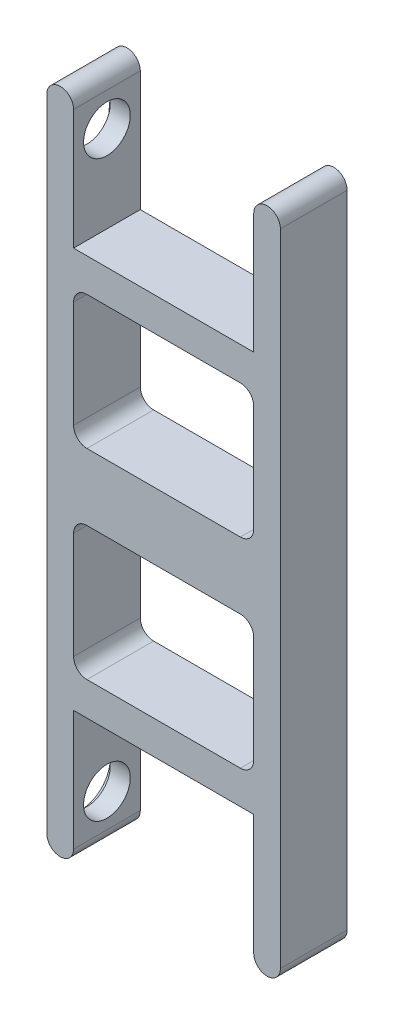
ISO-10303-21;
HEADER;
FILE_DESCRIPTION(('STEP AP214'),'2;1');
FILE_NAME('part.step','',(''),(''),'','','');
FILE_SCHEMA(('AUTOMOTIVE_DESIGN { 1 0 10303 214 1 1 1 1 }'));
ENDSEC;
DATA;
#1=APPLICATION_CONTEXT('core data for automotive mechanical design processes');
#2=APPLICATION_PROTOCOL_DEFINITION('international standard','automotive_design',2000,#1);
#3=PRODUCT_CONTEXT('',#1,'mechanical');
#4=PRODUCT('Part','Part','',(#3));
#5=PRODUCT_RELATED_PRODUCT_CATEGORY('part','',(#4));
#6=PRODUCT_DEFINITION_FORMATION('','',#4);
#7=PRODUCT_DEFINITION_CONTEXT('part definition',#1,'design');
#8=PRODUCT_DEFINITION('design','',#6,#7);
#9=PRODUCT_DEFINITION_SHAPE('','',#8);
#10=(LENGTH_UNIT() NAMED_UNIT(*) SI_UNIT(.MILLI.,.METRE.));
#11=(NAMED_UNIT(*) PLANE_ANGLE_UNIT() SI_UNIT($,.RADIAN.));
#12=(NAMED_UNIT(*) SI_UNIT($,.STERADIAN.) SOLID_ANGLE_UNIT());
#13=UNCERTAINTY_MEASURE_WITH_UNIT(LENGTH_MEASURE(1.E-05),#10,'distance_accuracy_value','');
#14=(GEOMETRIC_REPRESENTATION_CONTEXT(3) GLOBAL_UNCERTAINTY_ASSIGNED_CONTEXT((#13)) GLOBAL_UNIT_ASSIGNED_CONTEXT((#10,
#11,#12)) REPRESENTATION_CONTEXT('',''));
#15=CARTESIAN_POINT('',(0.,0.,0.));
#16=DIRECTION('',(0.,0.,1.));
#17=DIRECTION('',(1.,0.,0.));
#18=AXIS2_PLACEMENT_3D('',#15,#16,#17);
#19=CARTESIAN_POINT('',(17.501,-43.,5.));
#20=DIRECTION('',(-1.,0.,0.));
#21=DIRECTION('',(0.,0.,1.));
#22=AXIS2_PLACEMENT_3D('',#19,#20,#21);
#23=CYLINDRICAL_SURFACE('',#22,3.5);
#24=CARTESIAN_POINT('',(-13.5000000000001,-43.,5.));
#25=DIRECTION('',(-1.,0.,0.));
#26=DIRECTION('',(0.,-1.,0.));
#27=AXIS2_PLACEMENT_3D('',#24,#25,#26);
#28=CIRCLE('',#27,3.5);
#29=CARTESIAN_POINT('',(-13.5000000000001,-46.5,5.));
#30=VERTEX_POINT('',#29);
#31=EDGE_CURVE('E369',#30,#30,#28,.F.);
#32=ORIENTED_EDGE('',*,*,#31,.T.);
#33=EDGE_LOOP('',(#32));
#34=FACE_BOUND('',#33,.T.);
#35=CARTESIAN_POINT('',(-16.5,-43.,5.));
#36=DIRECTION('',(-1.,0.,0.));
#37=DIRECTION('',(0.,0.,1.));
#38=AXIS2_PLACEMENT_3D('',#35,#36,#37);
#39=CIRCLE('',#38,3.5);
#40=CARTESIAN_POINT('',(-16.5,-43.,8.5));
#41=VERTEX_POINT('',#40);
#42=EDGE_CURVE('E322',#41,#41,#39,.F.);
#43=ORIENTED_EDGE('',*,*,#42,.F.);
#44=EDGE_LOOP('',(#43));
#45=FACE_BOUND('',#44,.T.);
#46=ADVANCED_FACE('F40',(#34,#45),#23,.F.);
#47=CARTESIAN_POINT('',(15.5,-48.,0.));
#48=DIRECTION('',(0.,0.,1.));
#49=DIRECTION('',(1.,0.,0.));
#50=AXIS2_PLACEMENT_3D('',#47,#48,#49);
#51=CYLINDRICAL_SURFACE('',#50,2.00000000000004);
#52=DIRECTION('',(0.,0.,1.));
#53=VECTOR('',#52,1.);
#54=CARTESIAN_POINT('',(13.4999999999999,-48.,0.));
#55=LINE('',#54,#53);
#56=CARTESIAN_POINT('',(13.4999999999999,-48.,0.));
#57=VERTEX_POINT('',#56);
#58=CARTESIAN_POINT('',(13.4999999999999,-48.,10.));
#59=VERTEX_POINT('',#58);
#60=EDGE_CURVE('E556',#57,#59,#55,.T.);
#61=ORIENTED_EDGE('',*,*,#60,.F.);
#62=CARTESIAN_POINT('',(15.5,-48.,0.));
#63=DIRECTION('',(0.,0.,-1.));
#64=DIRECTION('',(-1.,0.,0.));
#65=AXIS2_PLACEMENT_3D('',#62,#63,#64);
#66=CIRCLE('',#65,2.00000000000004);
#67=CARTESIAN_POINT('',(17.5,-48.,0.));
#68=VERTEX_POINT('',#67);
#69=EDGE_CURVE('E564',#68,#57,#66,.T.);
#70=ORIENTED_EDGE('',*,*,#69,.F.);
#71=DIRECTION('',(0.,0.,1.));
#72=VECTOR('',#71,1.);
#73=CARTESIAN_POINT('',(17.5,-48.,10.));
#74=LINE('',#73,#72);
#75=CARTESIAN_POINT('',(17.5,-48.,10.));
#76=VERTEX_POINT('',#75);
#77=EDGE_CURVE('E560',#76,#68,#74,.F.);
#78=ORIENTED_EDGE('',*,*,#77,.F.);
#79=CARTESIAN_POINT('',(15.5,-48.,10.));
#80=DIRECTION('',(0.,0.,-1.));
#81=DIRECTION('',(-1.,0.,0.));
#82=AXIS2_PLACEMENT_3D('',#79,#80,#81);
#83=CIRCLE('',#82,2.00000000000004);
#84=EDGE_CURVE('E567',#59,#76,#83,.F.);
#85=ORIENTED_EDGE('',*,*,#84,.F.);
#86=EDGE_LOOP('',(#61,#70,#78,#85));
#87=FACE_BOUND('',#86,.T.);
#88=ADVANCED_FACE('F695',(#87),#51,.T.);
#89=CARTESIAN_POINT('',(-15.5,-48.,10.));
#90=DIRECTION('',(0.,0.,1.));
#91=DIRECTION('',(1.,0.,0.));
#92=AXIS2_PLACEMENT_3D('',#89,#90,#91);
#93=CYLINDRICAL_SURFACE('',#92,1.99999999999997);
#94=DIRECTION('',(0.,0.,1.));
#95=VECTOR('',#94,1.);
#96=CARTESIAN_POINT('',(-13.5000000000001,-48.,0.));
#97=LINE('',#96,#95);
#98=CARTESIAN_POINT('',(-13.5000000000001,-48.,10.));
#99=VERTEX_POINT('',#98);
#100=CARTESIAN_POINT('',(-13.5000000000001,-48.,0.));
#101=VERTEX_POINT('',#100);
#102=EDGE_CURVE('E542',#99,#101,#97,.F.);
#103=ORIENTED_EDGE('',*,*,#102,.F.);
#104=CARTESIAN_POINT('',(-15.5,-48.,10.));
#105=DIRECTION('',(0.,0.,-1.));
#106=DIRECTION('',(-1.,0.,0.));
#107=AXIS2_PLACEMENT_3D('',#104,#105,#106);
#108=CIRCLE('',#107,1.99999999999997);
#109=CARTESIAN_POINT('',(-17.5,-47.9999999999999,10.));
#110=VERTEX_POINT('',#109);
#111=EDGE_CURVE('E550',#110,#99,#108,.F.);
#112=ORIENTED_EDGE('',*,*,#111,.F.);
#113=DIRECTION('',(0.,0.,1.));
#114=VECTOR('',#113,1.);
#115=CARTESIAN_POINT('',(-17.5,-48.,10.));
#116=LINE('',#115,#114);
#117=CARTESIAN_POINT('',(-17.5,-47.9999999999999,0.));
#118=VERTEX_POINT('',#117);
#119=EDGE_CURVE('E546',#118,#110,#116,.T.);
#120=ORIENTED_EDGE('',*,*,#119,.F.);
#121=CARTESIAN_POINT('',(-15.5,-48.,0.));
#122=DIRECTION('',(0.,0.,-1.));
#123=DIRECTION('',(-1.,0.,0.));
#124=AXIS2_PLACEMENT_3D('',#121,#122,#123);
#125=CIRCLE('',#124,1.99999999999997);
#126=EDGE_CURVE('E553',#101,#118,#125,.T.);
#127=ORIENTED_EDGE('',*,*,#126,.F.);
#128=EDGE_LOOP('',(#103,#112,#120,#127));
#129=FACE_BOUND('',#128,.T.);
#130=ADVANCED_FACE('F703',(#129),#93,.T.);
#131=CARTESIAN_POINT('',(15.5,48.,0.));
#132=DIRECTION('',(0.,0.,-1.));
#133=DIRECTION('',(-1.,0.,0.));
#134=AXIS2_PLACEMENT_3D('',#131,#132,#133);
#135=CYLINDRICAL_SURFACE('',#134,2.00000000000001);
#136=DIRECTION('',(0.,0.,-1.));
#137=VECTOR('',#136,1.);
#138=CARTESIAN_POINT('',(17.5,48.,10.));
#139=LINE('',#138,#137);
#140=CARTESIAN_POINT('',(17.5,48.,0.));
#141=VERTEX_POINT('',#140);
#142=CARTESIAN_POINT('',(17.5,48.,10.));
#143=VERTEX_POINT('',#142);
#144=EDGE_CURVE('E527',#141,#143,#139,.F.);
#145=ORIENTED_EDGE('',*,*,#144,.F.);
#146=CARTESIAN_POINT('',(15.5,48.,0.));
#147=DIRECTION('',(0.,0.,-1.));
#148=DIRECTION('',(-1.,0.,0.));
#149=AXIS2_PLACEMENT_3D('',#146,#147,#148);
#150=CIRCLE('',#149,2.00000000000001);
#151=CARTESIAN_POINT('',(13.5,48.,0.));
#152=VERTEX_POINT('',#151);
#153=EDGE_CURVE('E535',#152,#141,#150,.T.);
#154=ORIENTED_EDGE('',*,*,#153,.F.);
#155=DIRECTION('',(0.,0.,-1.));
#156=VECTOR('',#155,1.);
#157=CARTESIAN_POINT('',(13.5,48.,0.));
#158=LINE('',#157,#156);
#159=CARTESIAN_POINT('',(13.5,48.,10.));
#160=VERTEX_POINT('',#159);
#161=EDGE_CURVE('E531',#160,#152,#158,.T.);
#162=ORIENTED_EDGE('',*,*,#161,.F.);
#163=CARTESIAN_POINT('',(15.5,48.,10.));
#164=DIRECTION('',(0.,0.,-1.));
#165=DIRECTION('',(-1.,0.,0.));
#166=AXIS2_PLACEMENT_3D('',#163,#164,#165);
#167=CIRCLE('',#166,2.00000000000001);
#168=EDGE_CURVE('E539',#143,#160,#167,.F.);
#169=ORIENTED_EDGE('',*,*,#168,.F.);
#170=EDGE_LOOP('',(#145,#154,#162,#169));
#171=FACE_BOUND('',#170,.T.);
#172=ADVANCED_FACE('F790',(#171),#135,.T.);
#173=CARTESIAN_POINT('',(-15.5,48.,10.));
#174=DIRECTION('',(0.,0.,-1.));
#175=DIRECTION('',(-1.,0.,0.));
#176=AXIS2_PLACEMENT_3D('',#173,#174,#175);
#177=CYLINDRICAL_SURFACE('',#176,2.);
#178=DIRECTION('',(0.,0.,-1.));
#179=VECTOR('',#178,1.);
#180=CARTESIAN_POINT('',(-17.5,48.,10.));
#181=LINE('',#180,#179);
#182=CARTESIAN_POINT('',(-17.5,48.,10.));
#183=VERTEX_POINT('',#182);
#184=CARTESIAN_POINT('',(-17.5,48.,0.));
#185=VERTEX_POINT('',#184);
#186=EDGE_CURVE('E508',#183,#185,#181,.T.);
#187=ORIENTED_EDGE('',*,*,#186,.F.);
#188=CARTESIAN_POINT('',(-15.5,48.,10.));
#189=DIRECTION('',(0.,0.,-1.));
#190=DIRECTION('',(-1.,0.,0.));
#191=AXIS2_PLACEMENT_3D('',#188,#189,#190);
#192=CIRCLE('',#191,2.);
#193=CARTESIAN_POINT('',(-13.5,48.,10.));
#194=VERTEX_POINT('',#193);
#195=EDGE_CURVE('E521',#194,#183,#192,.F.);
#196=ORIENTED_EDGE('',*,*,#195,.F.);
#197=DIRECTION('',(0.,0.,-1.));
#198=VECTOR('',#197,1.);
#199=CARTESIAN_POINT('',(-13.5,48.,0.));
#200=LINE('',#199,#198);
#201=CARTESIAN_POINT('',(-13.5,48.,0.));
#202=VERTEX_POINT('',#201);
#203=EDGE_CURVE('E517',#202,#194,#200,.F.);
#204=ORIENTED_EDGE('',*,*,#203,.F.);
#205=CARTESIAN_POINT('',(-15.5,48.,0.));
#206=DIRECTION('',(0.,0.,-1.));
#207=DIRECTION('',(-1.,0.,0.));
#208=AXIS2_PLACEMENT_3D('',#205,#206,#207);
#209=CIRCLE('',#208,2.);
#210=EDGE_CURVE('E524',#185,#202,#209,.T.);
#211=ORIENTED_EDGE('',*,*,#210,.F.);
#212=EDGE_LOOP('',(#187,#196,#204,#211));
#213=FACE_BOUND('',#212,.T.);
#214=ADVANCED_FACE('F782',(#213),#177,.T.);
#215=CARTESIAN_POINT('',(17.5,-50.,10.));
#216=DIRECTION('',(-1.,0.,0.));
#217=DIRECTION('',(0.,0.,1.));
#218=AXIS2_PLACEMENT_3D('',#215,#216,#217);
#219=PLANE('',#218);
#220=DIRECTION('',(0.,1.,0.));
#221=VECTOR('',#220,1.);
#222=CARTESIAN_POINT('',(17.5,-50.,10.));
#223=LINE('',#222,#221);
#224=EDGE_CURVE('E500',#76,#143,#223,.T.);
#225=ORIENTED_EDGE('',*,*,#224,.F.);
#226=ORIENTED_EDGE('',*,*,#77,.T.);
#227=DIRECTION('',(0.,1.,0.));
#228=VECTOR('',#227,1.);
#229=CARTESIAN_POINT('',(17.5,-50.,0.));
#230=LINE('',#229,#228);
#231=EDGE_CURVE('E469',#68,#141,#230,.T.);
#232=ORIENTED_EDGE('',*,*,#231,.T.);
#233=ORIENTED_EDGE('',*,*,#144,.T.);
#234=EDGE_LOOP('',(#225,#226,#232,#233));
#235=FACE_BOUND('',#234,.T.);
#236=ADVANCED_FACE('F778',(#235),#219,.F.);
#237=CARTESIAN_POINT('',(-17.5,-50.,10.));
#238=DIRECTION('',(1.,0.,0.));
#239=DIRECTION('',(0.,0.,-1.));
#240=AXIS2_PLACEMENT_3D('',#237,#238,#239);
#241=PLANE('',#240);
#242=DIRECTION('',(0.,0.995037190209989,-0.0995037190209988));
#243=VECTOR('',#242,1.);
#244=CARTESIAN_POINT('',(-17.5,-43.,9.5));
#245=LINE('',#244,#243);
#246=CARTESIAN_POINT('',(-17.5,-43.,9.5));
#247=VERTEX_POINT('',#246);
#248=CARTESIAN_POINT('',(-17.5,-28.,8.));
#249=VERTEX_POINT('',#248);
#250=EDGE_CURVE('E312',#247,#249,#245,.T.);
#251=ORIENTED_EDGE('',*,*,#250,.F.);
#252=CARTESIAN_POINT('',(-17.5,-43.,5.));
#253=DIRECTION('',(-1.,0.,0.));
#254=DIRECTION('',(0.,0.,1.));
#255=AXIS2_PLACEMENT_3D('',#252,#253,#254);
#256=CIRCLE('',#255,4.5);
#257=CARTESIAN_POINT('',(-17.5,-43.,0.500000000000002));
#258=VERTEX_POINT('',#257);
#259=EDGE_CURVE('E58',#258,#247,#256,.T.);
#260=ORIENTED_EDGE('',*,*,#259,.F.);
#261=DIRECTION('',(0.,-0.995037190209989,-0.0995037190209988));
#262=VECTOR('',#261,1.);
#263=CARTESIAN_POINT('',(-17.5,-43.,0.500000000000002));
#264=LINE('',#263,#262);
#265=CARTESIAN_POINT('',(-17.5,-28.,2.));
#266=VERTEX_POINT('',#265);
#267=EDGE_CURVE('E299',#266,#258,#264,.T.);
#268=ORIENTED_EDGE('',*,*,#267,.F.);
#269=CARTESIAN_POINT('',(-17.5,-28.,5.));
#270=DIRECTION('',(-1.,0.,0.));
#271=DIRECTION('',(0.,0.,1.));
#272=AXIS2_PLACEMENT_3D('',#269,#270,#271);
#273=CIRCLE('',#272,3.);
#274=EDGE_CURVE('E303',#249,#266,#273,.T.);
#275=ORIENTED_EDGE('',*,*,#274,.F.);
#276=EDGE_LOOP('',(#251,#260,#268,#275));
#277=FACE_BOUND('',#276,.T.);
#278=DIRECTION('',(0.,0.995037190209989,0.099503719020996));
#279=VECTOR('',#278,1.);
#280=CARTESIAN_POINT('',(-17.5,43.,9.49999999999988));
#281=LINE('',#280,#279);
#282=CARTESIAN_POINT('',(-17.5,28.,7.99999999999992));
#283=VERTEX_POINT('',#282);
#284=CARTESIAN_POINT('',(-17.5,43.,9.49999999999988));
#285=VERTEX_POINT('',#284);
#286=EDGE_CURVE('E348',#283,#285,#281,.T.);
#287=ORIENTED_EDGE('',*,*,#286,.F.);
#288=CARTESIAN_POINT('',(-17.5,28.,4.99999999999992));
#289=DIRECTION('',(-1.,0.,0.));
#290=DIRECTION('',(0.,0.,-1.));
#291=AXIS2_PLACEMENT_3D('',#288,#289,#290);
#292=CIRCLE('',#291,3.);
#293=CARTESIAN_POINT('',(-17.5,28.,1.99999999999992));
#294=VERTEX_POINT('',#293);
#295=EDGE_CURVE('E66',#294,#283,#292,.T.);
#296=ORIENTED_EDGE('',*,*,#295,.F.);
#297=DIRECTION('',(0.,-0.995037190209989,0.0995037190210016));
#298=VECTOR('',#297,1.);
#299=CARTESIAN_POINT('',(-17.5,43.,0.499999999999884));
#300=LINE('',#299,#298);
#301=CARTESIAN_POINT('',(-17.5,43.,0.499999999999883));
#302=VERTEX_POINT('',#301);
#303=EDGE_CURVE('E333',#302,#294,#300,.T.);
#304=ORIENTED_EDGE('',*,*,#303,.F.);
#305=CARTESIAN_POINT('',(-17.5,43.,4.99999999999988));
#306=DIRECTION('',(-1.,0.,0.));
#307=DIRECTION('',(0.,0.,-1.));
#308=AXIS2_PLACEMENT_3D('',#305,#306,#307);
#309=CIRCLE('',#308,4.5);
#310=EDGE_CURVE('E352',#285,#302,#309,.T.);
#311=ORIENTED_EDGE('',*,*,#310,.F.);
#312=EDGE_LOOP('',(#287,#296,#304,#311));
#313=FACE_BOUND('',#312,.T.);
#314=DIRECTION('',(0.,-1.,0.));
#315=VECTOR('',#314,1.);
#316=CARTESIAN_POINT('',(-17.5,-50.,0.));
#317=LINE('',#316,#315);
#318=EDGE_CURVE('E504',#185,#118,#317,.T.);
#319=ORIENTED_EDGE('',*,*,#318,.T.);
#320=ORIENTED_EDGE('',*,*,#119,.T.);
#321=DIRECTION('',(0.,-1.,0.));
#322=VECTOR('',#321,1.);
#323=CARTESIAN_POINT('',(-17.5,-50.,10.));
#324=LINE('',#323,#322);
#325=EDGE_CURVE('E503',#183,#110,#324,.T.);
#326=ORIENTED_EDGE('',*,*,#325,.F.);
#327=ORIENTED_EDGE('',*,*,#186,.T.);
#328=EDGE_LOOP('',(#319,#320,#326,#327));
#329=FACE_BOUND('',#328,.T.);
#330=ADVANCED_FACE('F771',(#277,#313,#329),#241,.F.);
#331=CARTESIAN_POINT('',(0.,0.,10.));
#332=DIRECTION('',(0.,0.,-1.));
#333=DIRECTION('',(-1.,0.,0.));
#334=AXIS2_PLACEMENT_3D('',#331,#332,#333);
#335=PLANE('',#334);
#336=DIRECTION('',(0.,-1.,0.));
#337=VECTOR('',#336,1.);
#338=CARTESIAN_POINT('',(13.5,-25.,10.));
#339=LINE('',#338,#337);
#340=CARTESIAN_POINT('',(13.5,-7.,10.));
#341=VERTEX_POINT('',#340);
#342=CARTESIAN_POINT('',(13.5,-23.,10.));
#343=VERTEX_POINT('',#342);
#344=EDGE_CURVE('E387',#341,#343,#339,.T.);
#345=ORIENTED_EDGE('',*,*,#344,.T.);
#346=CARTESIAN_POINT('',(11.5,-23.,10.));
#347=DIRECTION('',(0.,0.,-1.));
#348=DIRECTION('',(-1.,0.,0.));
#349=AXIS2_PLACEMENT_3D('',#346,#347,#348);
#350=CIRCLE('',#349,2.);
#351=CARTESIAN_POINT('',(11.5,-25.,10.));
#352=VERTEX_POINT('',#351);
#353=EDGE_CURVE('E665',#343,#352,#350,.T.);
#354=ORIENTED_EDGE('',*,*,#353,.T.);
#355=DIRECTION('',(-1.,0.,0.));
#356=VECTOR('',#355,1.);
#357=CARTESIAN_POINT('',(-13.5,-25.,10.));
#358=LINE('',#357,#356);
#359=CARTESIAN_POINT('',(-11.5,-25.,10.));
#360=VERTEX_POINT('',#359);
#361=EDGE_CURVE('E391',#352,#360,#358,.T.);
#362=ORIENTED_EDGE('',*,*,#361,.T.);
#363=CARTESIAN_POINT('',(-11.5,-23.,10.));
#364=DIRECTION('',(0.,0.,-1.));
#365=DIRECTION('',(-1.,0.,0.));
#366=AXIS2_PLACEMENT_3D('',#363,#364,#365);
#367=CIRCLE('',#366,2.);
#368=CARTESIAN_POINT('',(-13.5,-23.,10.));
#369=VERTEX_POINT('',#368);
#370=EDGE_CURVE('E11',#360,#369,#367,.T.);
#371=ORIENTED_EDGE('',*,*,#370,.T.);
#372=DIRECTION('',(0.,1.,0.));
#373=VECTOR('',#372,1.);
#374=CARTESIAN_POINT('',(-13.5,-25.,10.));
#375=LINE('',#374,#373);
#376=CARTESIAN_POINT('',(-13.5,-7.,10.));
#377=VERTEX_POINT('',#376);
#378=EDGE_CURVE('E378',#369,#377,#375,.T.);
#379=ORIENTED_EDGE('',*,*,#378,.T.);
#380=CARTESIAN_POINT('',(-11.5,-7.,10.));
#381=DIRECTION('',(0.,0.,-1.));
#382=DIRECTION('',(-1.,0.,0.));
#383=AXIS2_PLACEMENT_3D('',#380,#381,#382);
#384=CIRCLE('',#383,2.);
#385=CARTESIAN_POINT('',(-11.5,-5.,10.));
#386=VERTEX_POINT('',#385);
#387=EDGE_CURVE('E653',#377,#386,#384,.T.);
#388=ORIENTED_EDGE('',*,*,#387,.T.);
#389=DIRECTION('',(1.,0.,0.));
#390=VECTOR('',#389,1.);
#391=CARTESIAN_POINT('',(-13.5,-5.,10.));
#392=LINE('',#391,#390);
#393=CARTESIAN_POINT('',(11.5,-5.,10.));
#394=VERTEX_POINT('',#393);
#395=EDGE_CURVE('E382',#386,#394,#392,.T.);
#396=ORIENTED_EDGE('',*,*,#395,.T.);
#397=CARTESIAN_POINT('',(11.5,-7.,10.));
#398=DIRECTION('',(0.,0.,-1.));
#399=DIRECTION('',(-1.,0.,0.));
#400=AXIS2_PLACEMENT_3D('',#397,#398,#399);
#401=CIRCLE('',#400,2.);
#402=EDGE_CURVE('E659',#394,#341,#401,.T.);
#403=ORIENTED_EDGE('',*,*,#402,.T.);
#404=EDGE_LOOP('',(#345,#354,#362,#371,#379,#388,#396,#403));
#405=FACE_BOUND('',#404,.T.);
#406=DIRECTION('',(0.,-1.,0.));
#407=VECTOR('',#406,1.);
#408=CARTESIAN_POINT('',(13.5,25.,10.));
#409=LINE('',#408,#407);
#410=CARTESIAN_POINT('',(13.5,23.,10.));
#411=VERTEX_POINT('',#410);
#412=CARTESIAN_POINT('',(13.5,7.00000000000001,10.));
#413=VERTEX_POINT('',#412);
#414=EDGE_CURVE('E421',#411,#413,#409,.T.);
#415=ORIENTED_EDGE('',*,*,#414,.T.);
#416=CARTESIAN_POINT('',(11.5,7.00000000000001,10.));
#417=DIRECTION('',(0.,0.,-1.));
#418=DIRECTION('',(-1.,0.,0.));
#419=AXIS2_PLACEMENT_3D('',#416,#417,#418);
#420=CIRCLE('',#419,2.);
#421=CARTESIAN_POINT('',(11.5,5.00000000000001,10.));
#422=VERTEX_POINT('',#421);
#423=EDGE_CURVE('E641',#413,#422,#420,.T.);
#424=ORIENTED_EDGE('',*,*,#423,.T.);
#425=DIRECTION('',(-1.,0.,0.));
#426=VECTOR('',#425,1.);
#427=CARTESIAN_POINT('',(-13.5,5.00000000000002,10.));
#428=LINE('',#427,#426);
#429=CARTESIAN_POINT('',(-11.5,5.00000000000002,10.));
#430=VERTEX_POINT('',#429);
#431=EDGE_CURVE('E401',#422,#430,#428,.T.);
#432=ORIENTED_EDGE('',*,*,#431,.T.);
#433=CARTESIAN_POINT('',(-11.5,7.00000000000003,10.));
#434=DIRECTION('',(0.,0.,-1.));
#435=DIRECTION('',(-1.,0.,0.));
#436=AXIS2_PLACEMENT_3D('',#433,#434,#435);
#437=CIRCLE('',#436,2.);
#438=CARTESIAN_POINT('',(-13.5,7.00000000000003,10.));
#439=VERTEX_POINT('',#438);
#440=EDGE_CURVE('E647',#430,#439,#437,.T.);
#441=ORIENTED_EDGE('',*,*,#440,.T.);
#442=DIRECTION('',(0.,1.,0.));
#443=VECTOR('',#442,1.);
#444=CARTESIAN_POINT('',(-13.5,25.,10.));
#445=LINE('',#444,#443);
#446=CARTESIAN_POINT('',(-13.5,23.,10.));
#447=VERTEX_POINT('',#446);
#448=EDGE_CURVE('E412',#439,#447,#445,.T.);
#449=ORIENTED_EDGE('',*,*,#448,.T.);
#450=CARTESIAN_POINT('',(-11.5,23.,10.));
#451=DIRECTION('',(0.,0.,-1.));
#452=DIRECTION('',(-1.,0.,0.));
#453=AXIS2_PLACEMENT_3D('',#450,#451,#452);
#454=CIRCLE('',#453,2.);
#455=CARTESIAN_POINT('',(-11.5,25.,10.));
#456=VERTEX_POINT('',#455);
#457=EDGE_CURVE('E635',#447,#456,#454,.T.);
#458=ORIENTED_EDGE('',*,*,#457,.T.);
#459=DIRECTION('',(1.,0.,0.));
#460=VECTOR('',#459,1.);
#461=CARTESIAN_POINT('',(-13.5,25.,10.));
#462=LINE('',#461,#460);
#463=CARTESIAN_POINT('',(11.5,25.,10.));
#464=VERTEX_POINT('',#463);
#465=EDGE_CURVE('E416',#456,#464,#462,.T.);
#466=ORIENTED_EDGE('',*,*,#465,.T.);
#467=CARTESIAN_POINT('',(11.5,23.,10.));
#468=DIRECTION('',(0.,0.,-1.));
#469=DIRECTION('',(-1.,0.,0.));
#470=AXIS2_PLACEMENT_3D('',#467,#468,#469);
#471=CIRCLE('',#470,2.);
#472=EDGE_CURVE('E629',#464,#411,#471,.T.);
#473=ORIENTED_EDGE('',*,*,#472,.T.);
#474=EDGE_LOOP('',(#415,#424,#432,#441,#449,#458,#466,#473));
#475=FACE_BOUND('',#474,.T.);
#476=DIRECTION('',(0.,1.,0.));
#477=VECTOR('',#476,1.);
#478=CARTESIAN_POINT('',(13.4999999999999,-50.,10.));
#479=LINE('',#478,#477);
#480=CARTESIAN_POINT('',(13.5,-30.,10.));
#481=VERTEX_POINT('',#480);
#482=EDGE_CURVE('E489',#59,#481,#479,.T.);
#483=ORIENTED_EDGE('',*,*,#482,.F.);
#484=ORIENTED_EDGE('',*,*,#84,.T.);
#485=ORIENTED_EDGE('',*,*,#224,.T.);
#486=ORIENTED_EDGE('',*,*,#168,.T.);
#487=DIRECTION('',(0.,1.,0.));
#488=VECTOR('',#487,1.);
#489=CARTESIAN_POINT('',(13.5,50.,10.));
#490=LINE('',#489,#488);
#491=CARTESIAN_POINT('',(13.5,30.,10.));
#492=VERTEX_POINT('',#491);
#493=EDGE_CURVE('E446',#492,#160,#490,.T.);
#494=ORIENTED_EDGE('',*,*,#493,.F.);
#495=DIRECTION('',(1.,0.,0.));
#496=VECTOR('',#495,1.);
#497=CARTESIAN_POINT('',(-13.5,30.,10.));
#498=LINE('',#497,#496);
#499=CARTESIAN_POINT('',(-13.5,30.,10.));
#500=VERTEX_POINT('',#499);
#501=EDGE_CURVE('E458',#500,#492,#498,.T.);
#502=ORIENTED_EDGE('',*,*,#501,.F.);
#503=DIRECTION('',(0.,-1.,0.));
#504=VECTOR('',#503,1.);
#505=CARTESIAN_POINT('',(-13.5,50.,10.));
#506=LINE('',#505,#504);
#507=EDGE_CURVE('E455',#194,#500,#506,.T.);
#508=ORIENTED_EDGE('',*,*,#507,.F.);
#509=ORIENTED_EDGE('',*,*,#195,.T.);
#510=ORIENTED_EDGE('',*,*,#325,.T.);
#511=ORIENTED_EDGE('',*,*,#111,.T.);
#512=DIRECTION('',(0.,-1.,0.));
#513=VECTOR('',#512,1.);
#514=CARTESIAN_POINT('',(-13.5000000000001,-50.,10.));
#515=LINE('',#514,#513);
#516=CARTESIAN_POINT('',(-13.5,-30.,10.));
#517=VERTEX_POINT('',#516);
#518=EDGE_CURVE('E395',#517,#99,#515,.T.);
#519=ORIENTED_EDGE('',*,*,#518,.F.);
#520=DIRECTION('',(-1.,0.,0.));
#521=VECTOR('',#520,1.);
#522=CARTESIAN_POINT('',(-13.5,-30.,10.));
#523=LINE('',#522,#521);
#524=EDGE_CURVE('E478',#481,#517,#523,.T.);
#525=ORIENTED_EDGE('',*,*,#524,.F.);
#526=EDGE_LOOP('',(#483,#484,#485,#486,#494,#502,#508,#509,#510,#511,#519,#525));
#527=FACE_BOUND('',#526,.T.);
#528=ADVANCED_FACE('F768',(#405,#475,#527),#335,.F.);
#529=CARTESIAN_POINT('',(0.,0.,0.));
#530=DIRECTION('',(0.,0.,-1.));
#531=DIRECTION('',(-1.,0.,0.));
#532=AXIS2_PLACEMENT_3D('',#529,#530,#531);
#533=PLANE('',#532);
#534=DIRECTION('',(0.,1.,0.));
#535=VECTOR('',#534,1.);
#536=CARTESIAN_POINT('',(-13.5,-25.,0.));
#537=LINE('',#536,#535);
#538=CARTESIAN_POINT('',(-13.5,-23.,0.));
#539=VERTEX_POINT('',#538);
#540=CARTESIAN_POINT('',(-13.5,-7.,0.));
#541=VERTEX_POINT('',#540);
#542=EDGE_CURVE('E396',#539,#541,#537,.T.);
#543=ORIENTED_EDGE('',*,*,#542,.F.);
#544=CARTESIAN_POINT('',(-11.5,-23.,0.));
#545=DIRECTION('',(0.,0.,-1.));
#546=DIRECTION('',(-1.,0.,0.));
#547=AXIS2_PLACEMENT_3D('',#544,#545,#546);
#548=CIRCLE('',#547,2.);
#549=CARTESIAN_POINT('',(-11.5,-25.,0.));
#550=VERTEX_POINT('',#549);
#551=EDGE_CURVE('E50',#539,#550,#548,.F.);
#552=ORIENTED_EDGE('',*,*,#551,.T.);
#553=DIRECTION('',(-1.,0.,0.));
#554=VECTOR('',#553,1.);
#555=CARTESIAN_POINT('',(-13.5,-25.,0.));
#556=LINE('',#555,#554);
#557=CARTESIAN_POINT('',(11.5,-25.,0.));
#558=VERTEX_POINT('',#557);
#559=EDGE_CURVE('E383',#558,#550,#556,.T.);
#560=ORIENTED_EDGE('',*,*,#559,.F.);
#561=CARTESIAN_POINT('',(11.5,-23.,0.));
#562=DIRECTION('',(0.,0.,-1.));
#563=DIRECTION('',(-1.,0.,0.));
#564=AXIS2_PLACEMENT_3D('',#561,#562,#563);
#565=CIRCLE('',#564,2.);
#566=CARTESIAN_POINT('',(13.5,-23.,0.));
#567=VERTEX_POINT('',#566);
#568=EDGE_CURVE('E662',#558,#567,#565,.F.);
#569=ORIENTED_EDGE('',*,*,#568,.T.);
#570=DIRECTION('',(0.,-1.,0.));
#571=VECTOR('',#570,1.);
#572=CARTESIAN_POINT('',(13.5,-25.,0.));
#573=LINE('',#572,#571);
#574=CARTESIAN_POINT('',(13.5,-7.,0.));
#575=VERTEX_POINT('',#574);
#576=EDGE_CURVE('E405',#575,#567,#573,.T.);
#577=ORIENTED_EDGE('',*,*,#576,.F.);
#578=CARTESIAN_POINT('',(11.5,-7.,0.));
#579=DIRECTION('',(0.,0.,-1.));
#580=DIRECTION('',(-1.,0.,0.));
#581=AXIS2_PLACEMENT_3D('',#578,#579,#580);
#582=CIRCLE('',#581,2.);
#583=CARTESIAN_POINT('',(11.5,-5.,0.));
#584=VERTEX_POINT('',#583);
#585=EDGE_CURVE('E656',#575,#584,#582,.F.);
#586=ORIENTED_EDGE('',*,*,#585,.T.);
#587=DIRECTION('',(1.,0.,0.));
#588=VECTOR('',#587,1.);
#589=CARTESIAN_POINT('',(-13.5,-5.,0.));
#590=LINE('',#589,#588);
#591=CARTESIAN_POINT('',(-11.5,-5.,0.));
#592=VERTEX_POINT('',#591);
#593=EDGE_CURVE('E400',#592,#584,#590,.T.);
#594=ORIENTED_EDGE('',*,*,#593,.F.);
#595=CARTESIAN_POINT('',(-11.5,-7.,0.));
#596=DIRECTION('',(0.,0.,-1.));
#597=DIRECTION('',(-1.,0.,0.));
#598=AXIS2_PLACEMENT_3D('',#595,#596,#597);
#599=CIRCLE('',#598,2.);
#600=EDGE_CURVE('E650',#592,#541,#599,.F.);
#601=ORIENTED_EDGE('',*,*,#600,.T.);
#602=EDGE_LOOP('',(#543,#552,#560,#569,#577,#586,#594,#601));
#603=FACE_BOUND('',#602,.T.);
#604=DIRECTION('',(0.,1.,0.));
#605=VECTOR('',#604,1.);
#606=CARTESIAN_POINT('',(-13.5,25.,0.));
#607=LINE('',#606,#605);
#608=CARTESIAN_POINT('',(-13.5,7.00000000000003,0.));
#609=VERTEX_POINT('',#608);
#610=CARTESIAN_POINT('',(-13.5,23.,0.));
#611=VERTEX_POINT('',#610);
#612=EDGE_CURVE('E373',#609,#611,#607,.T.);
#613=ORIENTED_EDGE('',*,*,#612,.F.);
#614=CARTESIAN_POINT('',(-11.5,7.00000000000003,0.));
#615=DIRECTION('',(0.,0.,-1.));
#616=DIRECTION('',(-1.,0.,0.));
#617=AXIS2_PLACEMENT_3D('',#614,#615,#616);
#618=CIRCLE('',#617,2.);
#619=CARTESIAN_POINT('',(-11.5,5.00000000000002,0.));
#620=VERTEX_POINT('',#619);
#621=EDGE_CURVE('E644',#609,#620,#618,.F.);
#622=ORIENTED_EDGE('',*,*,#621,.T.);
#623=DIRECTION('',(-1.,0.,0.));
#624=VECTOR('',#623,1.);
#625=CARTESIAN_POINT('',(-13.5,5.00000000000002,0.));
#626=LINE('',#625,#624);
#627=CARTESIAN_POINT('',(11.5,5.00000000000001,0.));
#628=VERTEX_POINT('',#627);
#629=EDGE_CURVE('E417',#628,#620,#626,.T.);
#630=ORIENTED_EDGE('',*,*,#629,.F.);
#631=CARTESIAN_POINT('',(11.5,7.00000000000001,0.));
#632=DIRECTION('',(0.,0.,-1.));
#633=DIRECTION('',(-1.,0.,0.));
#634=AXIS2_PLACEMENT_3D('',#631,#632,#633);
#635=CIRCLE('',#634,2.);
#636=CARTESIAN_POINT('',(13.5,7.00000000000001,0.));
#637=VERTEX_POINT('',#636);
#638=EDGE_CURVE('E638',#628,#637,#635,.F.);
#639=ORIENTED_EDGE('',*,*,#638,.T.);
#640=DIRECTION('',(0.,-1.,0.));
#641=VECTOR('',#640,1.);
#642=CARTESIAN_POINT('',(13.5,25.,0.));
#643=LINE('',#642,#641);
#644=CARTESIAN_POINT('',(13.5,23.,0.));
#645=VERTEX_POINT('',#644);
#646=EDGE_CURVE('E435',#645,#637,#643,.T.);
#647=ORIENTED_EDGE('',*,*,#646,.F.);
#648=CARTESIAN_POINT('',(11.5,23.,0.));
#649=DIRECTION('',(0.,0.,-1.));
#650=DIRECTION('',(-1.,0.,0.));
#651=AXIS2_PLACEMENT_3D('',#648,#649,#650);
#652=CIRCLE('',#651,2.);
#653=CARTESIAN_POINT('',(11.5,25.,0.));
#654=VERTEX_POINT('',#653);
#655=EDGE_CURVE('E626',#645,#654,#652,.F.);
#656=ORIENTED_EDGE('',*,*,#655,.T.);
#657=DIRECTION('',(1.,0.,0.));
#658=VECTOR('',#657,1.);
#659=CARTESIAN_POINT('',(-13.5,25.,0.));
#660=LINE('',#659,#658);
#661=CARTESIAN_POINT('',(-11.5,25.,0.));
#662=VERTEX_POINT('',#661);
#663=EDGE_CURVE('E431',#662,#654,#660,.T.);
#664=ORIENTED_EDGE('',*,*,#663,.F.);
#665=CARTESIAN_POINT('',(-11.5,23.,0.));
#666=DIRECTION('',(0.,0.,-1.));
#667=DIRECTION('',(-1.,0.,0.));
#668=AXIS2_PLACEMENT_3D('',#665,#666,#667);
#669=CIRCLE('',#668,2.);
#670=EDGE_CURVE('E632',#662,#611,#669,.F.);
#671=ORIENTED_EDGE('',*,*,#670,.T.);
#672=EDGE_LOOP('',(#613,#622,#630,#639,#647,#656,#664,#671));
#673=FACE_BOUND('',#672,.T.);
#674=ORIENTED_EDGE('',*,*,#231,.F.);
#675=ORIENTED_EDGE('',*,*,#69,.T.);
#676=DIRECTION('',(0.,1.,0.));
#677=VECTOR('',#676,1.);
#678=CARTESIAN_POINT('',(13.4999999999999,-50.,0.));
#679=LINE('',#678,#677);
#680=CARTESIAN_POINT('',(13.5,-30.,0.));
#681=VERTEX_POINT('',#680);
#682=EDGE_CURVE('E477',#57,#681,#679,.T.);
#683=ORIENTED_EDGE('',*,*,#682,.T.);
#684=DIRECTION('',(-1.,0.,0.));
#685=VECTOR('',#684,1.);
#686=CARTESIAN_POINT('',(-13.5,-30.,0.));
#687=LINE('',#686,#685);
#688=CARTESIAN_POINT('',(-13.5,-30.,0.));
#689=VERTEX_POINT('',#688);
#690=EDGE_CURVE('E481',#681,#689,#687,.T.);
#691=ORIENTED_EDGE('',*,*,#690,.T.);
#692=DIRECTION('',(0.,-1.,0.));
#693=VECTOR('',#692,1.);
#694=CARTESIAN_POINT('',(-13.5000000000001,-50.,0.));
#695=LINE('',#694,#693);
#696=EDGE_CURVE('E473',#689,#101,#695,.T.);
#697=ORIENTED_EDGE('',*,*,#696,.T.);
#698=ORIENTED_EDGE('',*,*,#126,.T.);
#699=ORIENTED_EDGE('',*,*,#318,.F.);
#700=ORIENTED_EDGE('',*,*,#210,.T.);
#701=DIRECTION('',(0.,-1.,0.));
#702=VECTOR('',#701,1.);
#703=CARTESIAN_POINT('',(-13.5,50.,0.));
#704=LINE('',#703,#702);
#705=CARTESIAN_POINT('',(-13.5,30.,0.));
#706=VERTEX_POINT('',#705);
#707=EDGE_CURVE('E442',#202,#706,#704,.T.);
#708=ORIENTED_EDGE('',*,*,#707,.T.);
#709=DIRECTION('',(1.,0.,0.));
#710=VECTOR('',#709,1.);
#711=CARTESIAN_POINT('',(-13.5,30.,0.));
#712=LINE('',#711,#710);
#713=CARTESIAN_POINT('',(13.5,30.,0.));
#714=VERTEX_POINT('',#713);
#715=EDGE_CURVE('E445',#706,#714,#712,.T.);
#716=ORIENTED_EDGE('',*,*,#715,.T.);
#717=DIRECTION('',(0.,1.,0.));
#718=VECTOR('',#717,1.);
#719=CARTESIAN_POINT('',(13.5,50.,0.));
#720=LINE('',#719,#718);
#721=EDGE_CURVE('E450',#714,#152,#720,.T.);
#722=ORIENTED_EDGE('',*,*,#721,.T.);
#723=ORIENTED_EDGE('',*,*,#153,.T.);
#724=EDGE_LOOP('',(#674,#675,#683,#691,#697,#698,#699,#700,#708,#716,#722,#723));
#725=FACE_BOUND('',#724,.T.);
#726=ADVANCED_FACE('F766',(#603,#673,#725),#533,.T.);
#727=CARTESIAN_POINT('',(-13.5000000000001,-50.,0.));
#728=DIRECTION('',(-1.,0.,0.));
#729=DIRECTION('',(0.,-1.,0.));
#730=AXIS2_PLACEMENT_3D('',#727,#728,#729);
#731=PLANE('',#730);
#732=ORIENTED_EDGE('',*,*,#31,.F.);
#733=EDGE_LOOP('',(#732));
#734=FACE_BOUND('',#733,.T.);
#735=ORIENTED_EDGE('',*,*,#518,.T.);
#736=ORIENTED_EDGE('',*,*,#102,.T.);
#737=ORIENTED_EDGE('',*,*,#696,.F.);
#738=DIRECTION('',(0.,0.,1.));
#739=VECTOR('',#738,1.);
#740=CARTESIAN_POINT('',(-13.5,-30.,0.));
#741=LINE('',#740,#739);
#742=EDGE_CURVE('E459',#689,#517,#741,.T.);
#743=ORIENTED_EDGE('',*,*,#742,.T.);
#744=EDGE_LOOP('',(#735,#736,#737,#743));
#745=FACE_BOUND('',#744,.T.);
#746=ADVANCED_FACE('F759',(#734,#745),#731,.F.);
#747=CARTESIAN_POINT('',(-13.5,-30.,0.));
#748=DIRECTION('',(0.,1.,0.));
#749=DIRECTION('',(-1.,0.,0.));
#750=AXIS2_PLACEMENT_3D('',#747,#748,#749);
#751=PLANE('',#750);
#752=ORIENTED_EDGE('',*,*,#524,.T.);
#753=ORIENTED_EDGE('',*,*,#742,.F.);
#754=ORIENTED_EDGE('',*,*,#690,.F.);
#755=DIRECTION('',(0.,0.,1.));
#756=VECTOR('',#755,1.);
#757=CARTESIAN_POINT('',(13.5,-30.,0.));
#758=LINE('',#757,#756);
#759=EDGE_CURVE('E485',#681,#481,#758,.T.);
#760=ORIENTED_EDGE('',*,*,#759,.T.);
#761=EDGE_LOOP('',(#752,#753,#754,#760));
#762=FACE_BOUND('',#761,.T.);
#763=ADVANCED_FACE('F756',(#762),#751,.F.);
#764=CARTESIAN_POINT('',(13.4999999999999,-50.,0.));
#765=DIRECTION('',(1.,0.,0.));
#766=DIRECTION('',(0.,1.,0.));
#767=AXIS2_PLACEMENT_3D('',#764,#765,#766);
#768=PLANE('',#767);
#769=ORIENTED_EDGE('',*,*,#682,.F.);
#770=ORIENTED_EDGE('',*,*,#60,.T.);
#771=ORIENTED_EDGE('',*,*,#482,.T.);
#772=ORIENTED_EDGE('',*,*,#759,.F.);
#773=EDGE_LOOP('',(#769,#770,#771,#772));
#774=FACE_BOUND('',#773,.T.);
#775=ADVANCED_FACE('F754',(#774),#768,.F.);
#776=CARTESIAN_POINT('',(-13.5,50.,0.));
#777=DIRECTION('',(-1.,0.,0.));
#778=DIRECTION('',(0.,0.,1.));
#779=AXIS2_PLACEMENT_3D('',#776,#777,#778);
#780=PLANE('',#779);
#781=CARTESIAN_POINT('',(-13.5,43.,5.));
#782=DIRECTION('',(-1.,0.,0.));
#783=DIRECTION('',(0.,0.,1.));
#784=AXIS2_PLACEMENT_3D('',#781,#782,#783);
#785=CIRCLE('',#784,3.5);
#786=CARTESIAN_POINT('',(-13.5,43.,8.5));
#787=VERTEX_POINT('',#786);
#788=EDGE_CURVE('E374',#787,#787,#785,.F.);
#789=ORIENTED_EDGE('',*,*,#788,.F.);
#790=EDGE_LOOP('',(#789));
#791=FACE_BOUND('',#790,.T.);
#792=ORIENTED_EDGE('',*,*,#707,.F.);
#793=ORIENTED_EDGE('',*,*,#203,.T.);
#794=ORIENTED_EDGE('',*,*,#507,.T.);
#795=DIRECTION('',(0.,0.,1.));
#796=VECTOR('',#795,1.);
#797=CARTESIAN_POINT('',(-13.5,30.,0.));
#798=LINE('',#797,#796);
#799=EDGE_CURVE('E454',#706,#500,#798,.T.);
#800=ORIENTED_EDGE('',*,*,#799,.F.);
#801=EDGE_LOOP('',(#792,#793,#794,#800));
#802=FACE_BOUND('',#801,.T.);
#803=ADVANCED_FACE('F747',(#791,#802),#780,.F.);
#804=CARTESIAN_POINT('',(13.5,50.,0.));
#805=DIRECTION('',(1.,0.,0.));
#806=DIRECTION('',(0.,0.,-1.));
#807=AXIS2_PLACEMENT_3D('',#804,#805,#806);
#808=PLANE('',#807);
#809=ORIENTED_EDGE('',*,*,#493,.T.);
#810=ORIENTED_EDGE('',*,*,#161,.T.);
#811=ORIENTED_EDGE('',*,*,#721,.F.);
#812=DIRECTION('',(0.,0.,1.));
#813=VECTOR('',#812,1.);
#814=CARTESIAN_POINT('',(13.5,30.,0.));
#815=LINE('',#814,#813);
#816=EDGE_CURVE('E466',#714,#492,#815,.T.);
#817=ORIENTED_EDGE('',*,*,#816,.T.);
#818=EDGE_LOOP('',(#809,#810,#811,#817));
#819=FACE_BOUND('',#818,.T.);
#820=ADVANCED_FACE('F744',(#819),#808,.F.);
#821=CARTESIAN_POINT('',(-13.5,30.,0.));
#822=DIRECTION('',(0.,-1.,0.));
#823=DIRECTION('',(0.,0.,-1.));
#824=AXIS2_PLACEMENT_3D('',#821,#822,#823);
#825=PLANE('',#824);
#826=ORIENTED_EDGE('',*,*,#501,.T.);
#827=ORIENTED_EDGE('',*,*,#816,.F.);
#828=ORIENTED_EDGE('',*,*,#715,.F.);
#829=ORIENTED_EDGE('',*,*,#799,.T.);
#830=EDGE_LOOP('',(#826,#827,#828,#829));
#831=FACE_BOUND('',#830,.T.);
#832=ADVANCED_FACE('F742',(#831),#825,.F.);
#833=CARTESIAN_POINT('',(-13.5,25.,10.));
#834=DIRECTION('',(-1.,0.,0.));
#835=DIRECTION('',(0.,-1.,0.));
#836=AXIS2_PLACEMENT_3D('',#833,#834,#835);
#837=PLANE('',#836);
#838=ORIENTED_EDGE('',*,*,#612,.T.);
#839=DIRECTION('',(0.,0.,-1.));
#840=VECTOR('',#839,1.);
#841=CARTESIAN_POINT('',(-13.5,23.,10.));
#842=LINE('',#841,#840);
#843=EDGE_CURVE('E588',#611,#447,#842,.F.);
#844=ORIENTED_EDGE('',*,*,#843,.T.);
#845=ORIENTED_EDGE('',*,*,#448,.F.);
#846=DIRECTION('',(0.,0.,-1.));
#847=VECTOR('',#846,1.);
#848=CARTESIAN_POINT('',(-13.5,7.00000000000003,0.));
#849=LINE('',#848,#847);
#850=EDGE_CURVE('E584',#439,#609,#849,.T.);
#851=ORIENTED_EDGE('',*,*,#850,.T.);
#852=EDGE_LOOP('',(#838,#844,#845,#851));
#853=FACE_BOUND('',#852,.T.);
#854=ADVANCED_FACE('F732',(#853),#837,.F.);
#855=CARTESIAN_POINT('',(-13.5,5.00000000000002,10.));
#856=DIRECTION('',(0.,-1.,0.));
#857=DIRECTION('',(1.,0.,0.));
#858=AXIS2_PLACEMENT_3D('',#855,#856,#857);
#859=PLANE('',#858);
#860=ORIENTED_EDGE('',*,*,#431,.F.);
#861=DIRECTION('',(0.,0.,-1.));
#862=VECTOR('',#861,1.);
#863=CARTESIAN_POINT('',(11.5,5.00000000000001,0.));
#864=LINE('',#863,#862);
#865=EDGE_CURVE('E594',#422,#628,#864,.T.);
#866=ORIENTED_EDGE('',*,*,#865,.T.);
#867=ORIENTED_EDGE('',*,*,#629,.T.);
#868=DIRECTION('',(0.,0.,-1.));
#869=VECTOR('',#868,1.);
#870=CARTESIAN_POINT('',(-11.5,5.00000000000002,10.));
#871=LINE('',#870,#869);
#872=EDGE_CURVE('E591',#620,#430,#871,.F.);
#873=ORIENTED_EDGE('',*,*,#872,.T.);
#874=EDGE_LOOP('',(#860,#866,#867,#873));
#875=FACE_BOUND('',#874,.T.);
#876=ADVANCED_FACE('F728',(#875),#859,.F.);
#877=CARTESIAN_POINT('',(13.5,25.,10.));
#878=DIRECTION('',(1.,0.,0.));
#879=DIRECTION('',(0.,1.,0.));
#880=AXIS2_PLACEMENT_3D('',#877,#878,#879);
#881=PLANE('',#880);
#882=ORIENTED_EDGE('',*,*,#414,.F.);
#883=DIRECTION('',(0.,0.,-1.));
#884=VECTOR('',#883,1.);
#885=CARTESIAN_POINT('',(13.5,23.,0.));
#886=LINE('',#885,#884);
#887=EDGE_CURVE('E573',#411,#645,#886,.T.);
#888=ORIENTED_EDGE('',*,*,#887,.T.);
#889=ORIENTED_EDGE('',*,*,#646,.T.);
#890=DIRECTION('',(0.,0.,-1.));
#891=VECTOR('',#890,1.);
#892=CARTESIAN_POINT('',(13.5,7.,10.));
#893=LINE('',#892,#891);
#894=EDGE_CURVE('E570',#637,#413,#893,.F.);
#895=ORIENTED_EDGE('',*,*,#894,.T.);
#896=EDGE_LOOP('',(#882,#888,#889,#895));
#897=FACE_BOUND('',#896,.T.);
#898=ADVANCED_FACE('F731',(#897),#881,.F.);
#899=CARTESIAN_POINT('',(-13.5,25.,10.));
#900=DIRECTION('',(0.,1.,0.));
#901=DIRECTION('',(-1.,0.,0.));
#902=AXIS2_PLACEMENT_3D('',#899,#900,#901);
#903=PLANE('',#902);
#904=ORIENTED_EDGE('',*,*,#663,.T.);
#905=DIRECTION('',(0.,0.,-1.));
#906=VECTOR('',#905,1.);
#907=CARTESIAN_POINT('',(11.5,25.,10.));
#908=LINE('',#907,#906);
#909=EDGE_CURVE('E581',#654,#464,#908,.F.);
#910=ORIENTED_EDGE('',*,*,#909,.T.);
#911=ORIENTED_EDGE('',*,*,#465,.F.);
#912=DIRECTION('',(0.,0.,-1.));
#913=VECTOR('',#912,1.);
#914=CARTESIAN_POINT('',(-11.5,25.,0.));
#915=LINE('',#914,#913);
#916=EDGE_CURVE('E577',#456,#662,#915,.T.);
#917=ORIENTED_EDGE('',*,*,#916,.T.);
#918=EDGE_LOOP('',(#904,#910,#911,#917));
#919=FACE_BOUND('',#918,.T.);
#920=ADVANCED_FACE('F726',(#919),#903,.F.);
#921=CARTESIAN_POINT('',(-13.5,-25.,10.));
#922=DIRECTION('',(-1.,0.,0.));
#923=DIRECTION('',(0.,0.,1.));
#924=AXIS2_PLACEMENT_3D('',#921,#922,#923);
#925=PLANE('',#924);
#926=ORIENTED_EDGE('',*,*,#542,.T.);
#927=DIRECTION('',(0.,0.,-1.));
#928=VECTOR('',#927,1.);
#929=CARTESIAN_POINT('',(-13.5,-7.,10.));
#930=LINE('',#929,#928);
#931=EDGE_CURVE('E609',#541,#377,#930,.F.);
#932=ORIENTED_EDGE('',*,*,#931,.T.);
#933=ORIENTED_EDGE('',*,*,#378,.F.);
#934=DIRECTION('',(0.,0.,-1.));
#935=VECTOR('',#934,1.);
#936=CARTESIAN_POINT('',(-13.5,-23.,0.));
#937=LINE('',#936,#935);
#938=EDGE_CURVE('E605',#369,#539,#937,.T.);
#939=ORIENTED_EDGE('',*,*,#938,.T.);
#940=EDGE_LOOP('',(#926,#932,#933,#939));
#941=FACE_BOUND('',#940,.T.);
#942=ADVANCED_FACE('F714',(#941),#925,.F.);
#943=CARTESIAN_POINT('',(-13.5,-25.,10.));
#944=DIRECTION('',(0.,-1.,0.));
#945=DIRECTION('',(0.,0.,-1.));
#946=AXIS2_PLACEMENT_3D('',#943,#944,#945);
#947=PLANE('',#946);
#948=ORIENTED_EDGE('',*,*,#361,.F.);
#949=DIRECTION('',(0.,0.,-1.));
#950=VECTOR('',#949,1.);
#951=CARTESIAN_POINT('',(11.5,-25.,0.));
#952=LINE('',#951,#950);
#953=EDGE_CURVE('E622',#352,#558,#952,.T.);
#954=ORIENTED_EDGE('',*,*,#953,.T.);
#955=ORIENTED_EDGE('',*,*,#559,.T.);
#956=DIRECTION('',(0.,0.,-1.));
#957=VECTOR('',#956,1.);
#958=CARTESIAN_POINT('',(-11.5,-25.,10.));
#959=LINE('',#958,#957);
#960=EDGE_CURVE('E619',#550,#360,#959,.F.);
#961=ORIENTED_EDGE('',*,*,#960,.T.);
#962=EDGE_LOOP('',(#948,#954,#955,#961));
#963=FACE_BOUND('',#962,.T.);
#964=ADVANCED_FACE('F710',(#963),#947,.F.);
#965=CARTESIAN_POINT('',(13.5,-25.,10.));
#966=DIRECTION('',(1.,0.,0.));
#967=DIRECTION('',(0.,0.,-1.));
#968=AXIS2_PLACEMENT_3D('',#965,#966,#967);
#969=PLANE('',#968);
#970=ORIENTED_EDGE('',*,*,#344,.F.);
#971=DIRECTION('',(0.,0.,-1.));
#972=VECTOR('',#971,1.);
#973=CARTESIAN_POINT('',(13.5,-7.,0.));
#974=LINE('',#973,#972);
#975=EDGE_CURVE('E615',#341,#575,#974,.T.);
#976=ORIENTED_EDGE('',*,*,#975,.T.);
#977=ORIENTED_EDGE('',*,*,#576,.T.);
#978=DIRECTION('',(0.,0.,-1.));
#979=VECTOR('',#978,1.);
#980=CARTESIAN_POINT('',(13.5,-23.,10.));
#981=LINE('',#980,#979);
#982=EDGE_CURVE('E612',#567,#343,#981,.F.);
#983=ORIENTED_EDGE('',*,*,#982,.T.);
#984=EDGE_LOOP('',(#970,#976,#977,#983));
#985=FACE_BOUND('',#984,.T.);
#986=ADVANCED_FACE('F713',(#985),#969,.F.);
#987=CARTESIAN_POINT('',(-13.5,-5.,10.));
#988=DIRECTION('',(0.,1.,0.));
#989=DIRECTION('',(0.,0.,1.));
#990=AXIS2_PLACEMENT_3D('',#987,#988,#989);
#991=PLANE('',#990);
#992=ORIENTED_EDGE('',*,*,#395,.F.);
#993=DIRECTION('',(0.,0.,-1.));
#994=VECTOR('',#993,1.);
#995=CARTESIAN_POINT('',(-11.5,-5.,0.));
#996=LINE('',#995,#994);
#997=EDGE_CURVE('E601',#386,#592,#996,.T.);
#998=ORIENTED_EDGE('',*,*,#997,.T.);
#999=ORIENTED_EDGE('',*,*,#593,.T.);
#1000=DIRECTION('',(0.,0.,-1.));
#1001=VECTOR('',#1000,1.);
#1002=CARTESIAN_POINT('',(11.5,-5.,10.));
#1003=LINE('',#1002,#1001);
#1004=EDGE_CURVE('E598',#584,#394,#1003,.F.);
#1005=ORIENTED_EDGE('',*,*,#1004,.T.);
#1006=EDGE_LOOP('',(#992,#998,#999,#1005));
#1007=FACE_BOUND('',#1006,.T.);
#1008=ADVANCED_FACE('F718',(#1007),#991,.F.);
#1009=CARTESIAN_POINT('',(11.5,23.,10.));
#1010=DIRECTION('',(0.,0.,1.));
#1011=DIRECTION('',(1.,0.,0.));
#1012=AXIS2_PLACEMENT_3D('',#1009,#1010,#1011);
#1013=CYLINDRICAL_SURFACE('',#1012,2.);
#1014=ORIENTED_EDGE('',*,*,#472,.F.);
#1015=ORIENTED_EDGE('',*,*,#909,.F.);
#1016=ORIENTED_EDGE('',*,*,#655,.F.);
#1017=ORIENTED_EDGE('',*,*,#887,.F.);
#1018=EDGE_LOOP('',(#1014,#1015,#1016,#1017));
#1019=FACE_BOUND('',#1018,.T.);
#1020=ADVANCED_FACE('F722',(#1019),#1013,.F.);
#1021=CARTESIAN_POINT('',(-11.5,23.,10.));
#1022=DIRECTION('',(0.,0.,1.));
#1023=DIRECTION('',(1.,0.,0.));
#1024=AXIS2_PLACEMENT_3D('',#1021,#1022,#1023);
#1025=CYLINDRICAL_SURFACE('',#1024,2.);
#1026=ORIENTED_EDGE('',*,*,#457,.F.);
#1027=ORIENTED_EDGE('',*,*,#843,.F.);
#1028=ORIENTED_EDGE('',*,*,#670,.F.);
#1029=ORIENTED_EDGE('',*,*,#916,.F.);
#1030=EDGE_LOOP('',(#1026,#1027,#1028,#1029));
#1031=FACE_BOUND('',#1030,.T.);
#1032=ADVANCED_FACE('F808',(#1031),#1025,.F.);
#1033=CARTESIAN_POINT('',(11.5,7.00000000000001,10.));
#1034=DIRECTION('',(0.,0.,1.));
#1035=DIRECTION('',(1.,0.,0.));
#1036=AXIS2_PLACEMENT_3D('',#1033,#1034,#1035);
#1037=CYLINDRICAL_SURFACE('',#1036,2.);
#1038=ORIENTED_EDGE('',*,*,#423,.F.);
#1039=ORIENTED_EDGE('',*,*,#894,.F.);
#1040=ORIENTED_EDGE('',*,*,#638,.F.);
#1041=ORIENTED_EDGE('',*,*,#865,.F.);
#1042=EDGE_LOOP('',(#1038,#1039,#1040,#1041));
#1043=FACE_BOUND('',#1042,.T.);
#1044=ADVANCED_FACE('F812',(#1043),#1037,.F.);
#1045=CARTESIAN_POINT('',(-11.5,7.00000000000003,10.));
#1046=DIRECTION('',(0.,0.,1.));
#1047=DIRECTION('',(1.,0.,0.));
#1048=AXIS2_PLACEMENT_3D('',#1045,#1046,#1047);
#1049=CYLINDRICAL_SURFACE('',#1048,2.);
#1050=ORIENTED_EDGE('',*,*,#440,.F.);
#1051=ORIENTED_EDGE('',*,*,#872,.F.);
#1052=ORIENTED_EDGE('',*,*,#621,.F.);
#1053=ORIENTED_EDGE('',*,*,#850,.F.);
#1054=EDGE_LOOP('',(#1050,#1051,#1052,#1053));
#1055=FACE_BOUND('',#1054,.T.);
#1056=ADVANCED_FACE('F816',(#1055),#1049,.F.);
#1057=CARTESIAN_POINT('',(-11.5,-7.,10.));
#1058=DIRECTION('',(0.,0.,1.));
#1059=DIRECTION('',(1.,0.,0.));
#1060=AXIS2_PLACEMENT_3D('',#1057,#1058,#1059);
#1061=CYLINDRICAL_SURFACE('',#1060,2.);
#1062=ORIENTED_EDGE('',*,*,#387,.F.);
#1063=ORIENTED_EDGE('',*,*,#931,.F.);
#1064=ORIENTED_EDGE('',*,*,#600,.F.);
#1065=ORIENTED_EDGE('',*,*,#997,.F.);
#1066=EDGE_LOOP('',(#1062,#1063,#1064,#1065));
#1067=FACE_BOUND('',#1066,.T.);
#1068=ADVANCED_FACE('F820',(#1067),#1061,.F.);
#1069=CARTESIAN_POINT('',(11.5,-7.,10.));
#1070=DIRECTION('',(0.,0.,1.));
#1071=DIRECTION('',(1.,0.,0.));
#1072=AXIS2_PLACEMENT_3D('',#1069,#1070,#1071);
#1073=CYLINDRICAL_SURFACE('',#1072,2.);
#1074=ORIENTED_EDGE('',*,*,#402,.F.);
#1075=ORIENTED_EDGE('',*,*,#1004,.F.);
#1076=ORIENTED_EDGE('',*,*,#585,.F.);
#1077=ORIENTED_EDGE('',*,*,#975,.F.);
#1078=EDGE_LOOP('',(#1074,#1075,#1076,#1077));
#1079=FACE_BOUND('',#1078,.T.);
#1080=ADVANCED_FACE('F824',(#1079),#1073,.F.);
#1081=CARTESIAN_POINT('',(11.5,-23.,10.));
#1082=DIRECTION('',(0.,0.,1.));
#1083=DIRECTION('',(1.,0.,0.));
#1084=AXIS2_PLACEMENT_3D('',#1081,#1082,#1083);
#1085=CYLINDRICAL_SURFACE('',#1084,2.);
#1086=ORIENTED_EDGE('',*,*,#353,.F.);
#1087=ORIENTED_EDGE('',*,*,#982,.F.);
#1088=ORIENTED_EDGE('',*,*,#568,.F.);
#1089=ORIENTED_EDGE('',*,*,#953,.F.);
#1090=EDGE_LOOP('',(#1086,#1087,#1088,#1089));
#1091=FACE_BOUND('',#1090,.T.);
#1092=ADVANCED_FACE('F827',(#1091),#1085,.F.);
#1093=CARTESIAN_POINT('',(-11.5,-23.,10.));
#1094=DIRECTION('',(0.,0.,1.));
#1095=DIRECTION('',(1.,0.,0.));
#1096=AXIS2_PLACEMENT_3D('',#1093,#1094,#1095);
#1097=CYLINDRICAL_SURFACE('',#1096,2.);
#1098=ORIENTED_EDGE('',*,*,#370,.F.);
#1099=ORIENTED_EDGE('',*,*,#960,.F.);
#1100=ORIENTED_EDGE('',*,*,#551,.F.);
#1101=ORIENTED_EDGE('',*,*,#938,.F.);
#1102=EDGE_LOOP('',(#1098,#1099,#1100,#1101));
#1103=FACE_BOUND('',#1102,.T.);
#1104=ADVANCED_FACE('F42',(#1103),#1097,.F.);
#1105=CARTESIAN_POINT('',(17.501,43.,5.));
#1106=DIRECTION('',(-1.,0.,0.));
#1107=DIRECTION('',(0.,0.,1.));
#1108=AXIS2_PLACEMENT_3D('',#1105,#1106,#1107);
#1109=CYLINDRICAL_SURFACE('',#1108,3.5);
#1110=CARTESIAN_POINT('',(-16.5,43.,5.));
#1111=DIRECTION('',(1.,0.,0.));
#1112=DIRECTION('',(0.,0.,-1.));
#1113=AXIS2_PLACEMENT_3D('',#1110,#1111,#1112);
#1114=CIRCLE('',#1113,3.5);
#1115=CARTESIAN_POINT('',(-16.5,43.,1.5));
#1116=VERTEX_POINT('',#1115);
#1117=EDGE_CURVE('E44',#1116,#1116,#1114,.F.);
#1118=ORIENTED_EDGE('',*,*,#1117,.T.);
#1119=EDGE_LOOP('',(#1118));
#1120=FACE_BOUND('',#1119,.T.);
#1121=ORIENTED_EDGE('',*,*,#788,.T.);
#1122=EDGE_LOOP('',(#1121));
#1123=FACE_BOUND('',#1122,.T.);
#1124=ADVANCED_FACE('F676',(#1120,#1123),#1109,.F.);
#1125=CARTESIAN_POINT('',(-16.5,-43.,5.));
#1126=DIRECTION('',(-1.,0.,0.));
#1127=DIRECTION('',(0.,0.,1.));
#1128=AXIS2_PLACEMENT_3D('',#1125,#1126,#1127);
#1129=PLANE('',#1128);
#1130=CARTESIAN_POINT('',(-16.5,-43.,5.));
#1131=DIRECTION('',(-1.,0.,0.));
#1132=DIRECTION('',(0.,0.,1.));
#1133=AXIS2_PLACEMENT_3D('',#1130,#1131,#1132);
#1134=CIRCLE('',#1133,4.5);
#1135=CARTESIAN_POINT('',(-16.5,-43.,0.500000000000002));
#1136=VERTEX_POINT('',#1135);
#1137=CARTESIAN_POINT('',(-16.5,-43.,9.5));
#1138=VERTEX_POINT('',#1137);
#1139=EDGE_CURVE('E277',#1136,#1138,#1134,.T.);
#1140=ORIENTED_EDGE('',*,*,#1139,.T.);
#1141=DIRECTION('',(0.,0.995037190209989,-0.0995037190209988));
#1142=VECTOR('',#1141,1.);
#1143=CARTESIAN_POINT('',(-16.5,-43.,9.5));
#1144=LINE('',#1143,#1142);
#1145=CARTESIAN_POINT('',(-16.5,-28.,8.));
#1146=VERTEX_POINT('',#1145);
#1147=EDGE_CURVE('E287',#1138,#1146,#1144,.T.);
#1148=ORIENTED_EDGE('',*,*,#1147,.T.);
#1149=CARTESIAN_POINT('',(-16.5,-28.,5.));
#1150=DIRECTION('',(-1.,0.,0.));
#1151=DIRECTION('',(0.,0.,1.));
#1152=AXIS2_PLACEMENT_3D('',#1149,#1150,#1151);
#1153=CIRCLE('',#1152,3.);
#1154=CARTESIAN_POINT('',(-16.5,-28.,2.));
#1155=VERTEX_POINT('',#1154);
#1156=EDGE_CURVE('E293',#1146,#1155,#1153,.T.);
#1157=ORIENTED_EDGE('',*,*,#1156,.T.);
#1158=DIRECTION('',(0.,-0.995037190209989,-0.0995037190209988));
#1159=VECTOR('',#1158,1.);
#1160=CARTESIAN_POINT('',(-16.5,-43.,0.500000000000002));
#1161=LINE('',#1160,#1159);
#1162=EDGE_CURVE('E284',#1155,#1136,#1161,.T.);
#1163=ORIENTED_EDGE('',*,*,#1162,.T.);
#1164=EDGE_LOOP('',(#1140,#1148,#1157,#1163));
#1165=FACE_BOUND('',#1164,.T.);
#1166=ORIENTED_EDGE('',*,*,#42,.T.);
#1167=EDGE_LOOP('',(#1166));
#1168=FACE_BOUND('',#1167,.T.);
#1169=ADVANCED_FACE('F295',(#1165,#1168),#1129,.T.);
#1170=CARTESIAN_POINT('',(-16.5,-43.,5.));
#1171=DIRECTION('',(-1.,0.,0.));
#1172=DIRECTION('',(0.,0.,1.));
#1173=AXIS2_PLACEMENT_3D('',#1170,#1171,#1172);
#1174=CYLINDRICAL_SURFACE('',#1173,4.5);
#1175=ORIENTED_EDGE('',*,*,#259,.T.);
#1176=DIRECTION('',(-1.,0.,0.));
#1177=VECTOR('',#1176,1.);
#1178=CARTESIAN_POINT('',(-16.5,-43.,9.5));
#1179=LINE('',#1178,#1177);
#1180=EDGE_CURVE('E273',#1138,#247,#1179,.T.);
#1181=ORIENTED_EDGE('',*,*,#1180,.F.);
#1182=ORIENTED_EDGE('',*,*,#1139,.F.);
#1183=DIRECTION('',(-1.,0.,0.));
#1184=VECTOR('',#1183,1.);
#1185=CARTESIAN_POINT('',(-16.5,-43.,0.500000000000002));
#1186=LINE('',#1185,#1184);
#1187=EDGE_CURVE('E319',#1136,#258,#1186,.T.);
#1188=ORIENTED_EDGE('',*,*,#1187,.T.);
#1189=EDGE_LOOP('',(#1175,#1181,#1182,#1188));
#1190=FACE_BOUND('',#1189,.T.);
#1191=ADVANCED_FACE('F275',(#1190),#1174,.F.);
#1192=CARTESIAN_POINT('',(-16.5,-43.,0.500000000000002));
#1193=DIRECTION('',(0.,0.0995037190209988,-0.995037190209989));
#1194=DIRECTION('',(0.,0.995037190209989,0.0995037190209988));
#1195=AXIS2_PLACEMENT_3D('',#1192,#1193,#1194);
#1196=PLANE('',#1195);
#1197=ORIENTED_EDGE('',*,*,#267,.T.);
#1198=ORIENTED_EDGE('',*,*,#1187,.F.);
#1199=ORIENTED_EDGE('',*,*,#1162,.F.);
#1200=DIRECTION('',(-1.,0.,0.));
#1201=VECTOR('',#1200,1.);
#1202=CARTESIAN_POINT('',(-16.5,-28.,2.));
#1203=LINE('',#1202,#1201);
#1204=EDGE_CURVE('E323',#1155,#266,#1203,.T.);
#1205=ORIENTED_EDGE('',*,*,#1204,.T.);
#1206=EDGE_LOOP('',(#1197,#1198,#1199,#1205));
#1207=FACE_BOUND('',#1206,.T.);
#1208=ADVANCED_FACE('F954',(#1207),#1196,.F.);
#1209=CARTESIAN_POINT('',(-16.5,-28.,5.));
#1210=DIRECTION('',(-1.,0.,0.));
#1211=DIRECTION('',(0.,0.,1.));
#1212=AXIS2_PLACEMENT_3D('',#1209,#1210,#1211);
#1213=CYLINDRICAL_SURFACE('',#1212,3.);
#1214=ORIENTED_EDGE('',*,*,#274,.T.);
#1215=ORIENTED_EDGE('',*,*,#1204,.F.);
#1216=ORIENTED_EDGE('',*,*,#1156,.F.);
#1217=DIRECTION('',(-1.,0.,0.));
#1218=VECTOR('',#1217,1.);
#1219=CARTESIAN_POINT('',(-16.5,-28.,8.));
#1220=LINE('',#1219,#1218);
#1221=EDGE_CURVE('E283',#1146,#249,#1220,.T.);
#1222=ORIENTED_EDGE('',*,*,#1221,.T.);
#1223=EDGE_LOOP('',(#1214,#1215,#1216,#1222));
#1224=FACE_BOUND('',#1223,.T.);
#1225=ADVANCED_FACE('F690',(#1224),#1213,.F.);
#1226=CARTESIAN_POINT('',(-16.5,-43.,9.5));
#1227=DIRECTION('',(0.,0.0995037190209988,0.995037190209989));
#1228=DIRECTION('',(0.,-0.995037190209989,0.0995037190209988));
#1229=AXIS2_PLACEMENT_3D('',#1226,#1227,#1228);
#1230=PLANE('',#1229);
#1231=ORIENTED_EDGE('',*,*,#250,.T.);
#1232=ORIENTED_EDGE('',*,*,#1221,.F.);
#1233=ORIENTED_EDGE('',*,*,#1147,.F.);
#1234=ORIENTED_EDGE('',*,*,#1180,.T.);
#1235=EDGE_LOOP('',(#1231,#1232,#1233,#1234));
#1236=FACE_BOUND('',#1235,.T.);
#1237=ADVANCED_FACE('F288',(#1236),#1230,.F.);
#1238=CARTESIAN_POINT('',(-16.5,28.,4.99999999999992));
#1239=DIRECTION('',(1.,0.,0.));
#1240=DIRECTION('',(0.,0.,-1.));
#1241=AXIS2_PLACEMENT_3D('',#1238,#1239,#1240);
#1242=PLANE('',#1241);
#1243=CARTESIAN_POINT('',(-16.5,28.,4.99999999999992));
#1244=DIRECTION('',(-1.,0.,0.));
#1245=DIRECTION('',(0.,0.,-1.));
#1246=AXIS2_PLACEMENT_3D('',#1243,#1244,#1245);
#1247=CIRCLE('',#1246,3.);
#1248=CARTESIAN_POINT('',(-16.5,28.,1.99999999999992));
#1249=VERTEX_POINT('',#1248);
#1250=CARTESIAN_POINT('',(-16.5,28.,7.99999999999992));
#1251=VERTEX_POINT('',#1250);
#1252=EDGE_CURVE('E328',#1249,#1251,#1247,.T.);
#1253=ORIENTED_EDGE('',*,*,#1252,.T.);
#1254=DIRECTION('',(0.,0.995037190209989,0.099503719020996));
#1255=VECTOR('',#1254,1.);
#1256=CARTESIAN_POINT('',(-16.5,43.,9.49999999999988));
#1257=LINE('',#1256,#1255);
#1258=CARTESIAN_POINT('',(-16.5,43.,9.49999999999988));
#1259=VERTEX_POINT('',#1258);
#1260=EDGE_CURVE('E332',#1251,#1259,#1257,.T.);
#1261=ORIENTED_EDGE('',*,*,#1260,.T.);
#1262=CARTESIAN_POINT('',(-16.5,43.,4.99999999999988));
#1263=DIRECTION('',(-1.,0.,0.));
#1264=DIRECTION('',(0.,0.,-1.));
#1265=AXIS2_PLACEMENT_3D('',#1262,#1263,#1264);
#1266=CIRCLE('',#1265,4.5);
#1267=CARTESIAN_POINT('',(-16.5,43.,0.499999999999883));
#1268=VERTEX_POINT('',#1267);
#1269=EDGE_CURVE('E337',#1259,#1268,#1266,.T.);
#1270=ORIENTED_EDGE('',*,*,#1269,.T.);
#1271=DIRECTION('',(0.,-0.995037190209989,0.0995037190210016));
#1272=VECTOR('',#1271,1.);
#1273=CARTESIAN_POINT('',(-16.5,43.,0.499999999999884));
#1274=LINE('',#1273,#1272);
#1275=EDGE_CURVE('E341',#1268,#1249,#1274,.T.);
#1276=ORIENTED_EDGE('',*,*,#1275,.T.);
#1277=EDGE_LOOP('',(#1253,#1261,#1270,#1276));
#1278=FACE_BOUND('',#1277,.T.);
#1279=ORIENTED_EDGE('',*,*,#1117,.F.);
#1280=EDGE_LOOP('',(#1279));
#1281=FACE_BOUND('',#1280,.T.);
#1282=ADVANCED_FACE('F679',(#1278,#1281),#1242,.F.);
#1283=CARTESIAN_POINT('',(-16.5,28.,4.99999999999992));
#1284=DIRECTION('',(-1.,0.,0.));
#1285=DIRECTION('',(0.,0.,1.));
#1286=AXIS2_PLACEMENT_3D('',#1283,#1284,#1285);
#1287=CYLINDRICAL_SURFACE('',#1286,3.);
#1288=ORIENTED_EDGE('',*,*,#295,.T.);
#1289=DIRECTION('',(-1.,0.,0.));
#1290=VECTOR('',#1289,1.);
#1291=CARTESIAN_POINT('',(-16.5,28.,7.99999999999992));
#1292=LINE('',#1291,#1290);
#1293=EDGE_CURVE('E345',#1251,#283,#1292,.T.);
#1294=ORIENTED_EDGE('',*,*,#1293,.F.);
#1295=ORIENTED_EDGE('',*,*,#1252,.F.);
#1296=DIRECTION('',(-1.,0.,0.));
#1297=VECTOR('',#1296,1.);
#1298=CARTESIAN_POINT('',(-16.5,28.,1.99999999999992));
#1299=LINE('',#1298,#1297);
#1300=EDGE_CURVE('E313',#1249,#294,#1299,.T.);
#1301=ORIENTED_EDGE('',*,*,#1300,.T.);
#1302=EDGE_LOOP('',(#1288,#1294,#1295,#1301));
#1303=FACE_BOUND('',#1302,.T.);
#1304=ADVANCED_FACE('F681',(#1303),#1287,.F.);
#1305=CARTESIAN_POINT('',(-16.5,43.,0.499999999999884));
#1306=DIRECTION('',(0.,-0.0995037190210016,-0.995037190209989));
#1307=DIRECTION('',(0.,0.995037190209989,-0.0995037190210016));
#1308=AXIS2_PLACEMENT_3D('',#1305,#1306,#1307);
#1309=PLANE('',#1308);
#1310=ORIENTED_EDGE('',*,*,#303,.T.);
#1311=ORIENTED_EDGE('',*,*,#1300,.F.);
#1312=ORIENTED_EDGE('',*,*,#1275,.F.);
#1313=DIRECTION('',(-1.,0.,0.));
#1314=VECTOR('',#1313,1.);
#1315=CARTESIAN_POINT('',(-16.5,43.,0.499999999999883));
#1316=LINE('',#1315,#1314);
#1317=EDGE_CURVE('E361',#1268,#302,#1316,.T.);
#1318=ORIENTED_EDGE('',*,*,#1317,.T.);
#1319=EDGE_LOOP('',(#1310,#1311,#1312,#1318));
#1320=FACE_BOUND('',#1319,.T.);
#1321=ADVANCED_FACE('F688',(#1320),#1309,.F.);
#1322=CARTESIAN_POINT('',(-16.5,43.,4.99999999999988));
#1323=DIRECTION('',(-1.,0.,0.));
#1324=DIRECTION('',(0.,0.,1.));
#1325=AXIS2_PLACEMENT_3D('',#1322,#1323,#1324);
#1326=CYLINDRICAL_SURFACE('',#1325,4.5);
#1327=ORIENTED_EDGE('',*,*,#310,.T.);
#1328=ORIENTED_EDGE('',*,*,#1317,.F.);
#1329=ORIENTED_EDGE('',*,*,#1269,.F.);
#1330=DIRECTION('',(-1.,0.,0.));
#1331=VECTOR('',#1330,1.);
#1332=CARTESIAN_POINT('',(-16.5,43.,9.49999999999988));
#1333=LINE('',#1332,#1331);
#1334=EDGE_CURVE('E364',#1259,#285,#1333,.T.);
#1335=ORIENTED_EDGE('',*,*,#1334,.T.);
#1336=EDGE_LOOP('',(#1327,#1328,#1329,#1335));
#1337=FACE_BOUND('',#1336,.T.);
#1338=ADVANCED_FACE('F996',(#1337),#1326,.F.);
#1339=CARTESIAN_POINT('',(-16.5,43.,9.49999999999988));
#1340=DIRECTION('',(0.,-0.099503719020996,0.995037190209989));
#1341=DIRECTION('',(0.,-0.995037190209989,-0.099503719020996));
#1342=AXIS2_PLACEMENT_3D('',#1339,#1340,#1341);
#1343=PLANE('',#1342);
#1344=ORIENTED_EDGE('',*,*,#286,.T.);
#1345=ORIENTED_EDGE('',*,*,#1334,.F.);
#1346=ORIENTED_EDGE('',*,*,#1260,.F.);
#1347=ORIENTED_EDGE('',*,*,#1293,.T.);
#1348=EDGE_LOOP('',(#1344,#1345,#1346,#1347));
#1349=FACE_BOUND('',#1348,.T.);
#1350=ADVANCED_FACE('F1005',(#1349),#1343,.F.);
#1351=CLOSED_SHELL('',(#46,#88,#130,#172,#214,#236,#330,#528,#726,#746,#763,#775,#803,#820,#832,
#854,#876,#898,#920,#942,#964,#986,#1008,#1020,#1032,#1044,#1056,#1068,#1080,#1092,#1104,#1124,
#1169,#1191,#1208,#1225,#1237,#1282,#1304,#1321,#1338,#1350));
#1352=MANIFOLD_SOLID_BREP('B2',#1351);
#1353=ADVANCED_BREP_SHAPE_REPRESENTATION('',(#18,#1352),#14);
#1354=SHAPE_DEFINITION_REPRESENTATION(#9,#1353);
ENDSEC;
END-ISO-10303-21;
